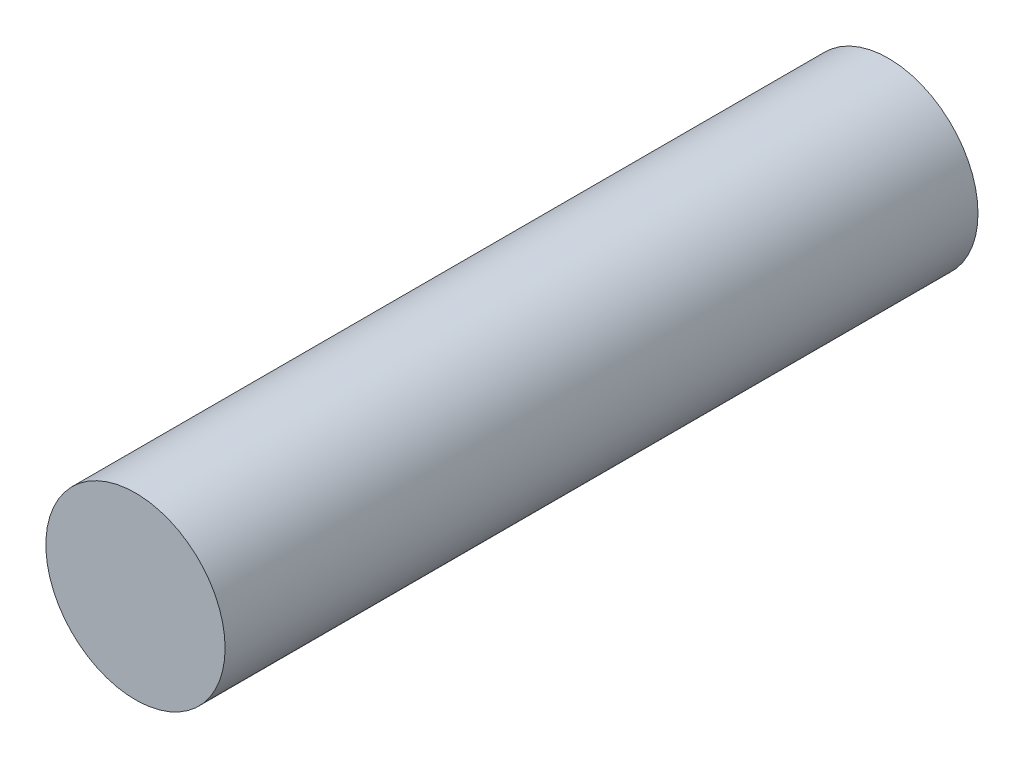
ISO-10303-21;
HEADER;
FILE_DESCRIPTION(('STEP AP214'),'2;1');
FILE_NAME('part.step','',(''),(''),'','','');
FILE_SCHEMA(('AUTOMOTIVE_DESIGN { 1 0 10303 214 1 1 1 1 }'));
ENDSEC;
DATA;
#1=APPLICATION_CONTEXT('core data for automotive mechanical design processes');
#2=APPLICATION_PROTOCOL_DEFINITION('international standard','automotive_design',2000,#1);
#3=PRODUCT_CONTEXT('',#1,'mechanical');
#4=PRODUCT('Part','Part','',(#3));
#5=PRODUCT_RELATED_PRODUCT_CATEGORY('part','',(#4));
#6=PRODUCT_DEFINITION_FORMATION('','',#4);
#7=PRODUCT_DEFINITION_CONTEXT('part definition',#1,'design');
#8=PRODUCT_DEFINITION('design','',#6,#7);
#9=PRODUCT_DEFINITION_SHAPE('','',#8);
#10=(LENGTH_UNIT() NAMED_UNIT(*) SI_UNIT(.MILLI.,.METRE.));
#11=(NAMED_UNIT(*) PLANE_ANGLE_UNIT() SI_UNIT($,.RADIAN.));
#12=(NAMED_UNIT(*) SI_UNIT($,.STERADIAN.) SOLID_ANGLE_UNIT());
#13=UNCERTAINTY_MEASURE_WITH_UNIT(LENGTH_MEASURE(1.E-05),#10,'distance_accuracy_value','');
#14=(GEOMETRIC_REPRESENTATION_CONTEXT(3) GLOBAL_UNCERTAINTY_ASSIGNED_CONTEXT((#13)) GLOBAL_UNIT_ASSIGNED_CONTEXT((#10,
#11,#12)) REPRESENTATION_CONTEXT('',''));
#15=CARTESIAN_POINT('',(0.,0.,0.));
#16=DIRECTION('',(0.,0.,1.));
#17=DIRECTION('',(1.,0.,0.));
#18=AXIS2_PLACEMENT_3D('',#15,#16,#17);
#19=CARTESIAN_POINT('',(0.,0.,-84.));
#20=DIRECTION('',(0.,0.,1.));
#21=DIRECTION('',(1.,0.,0.));
#22=AXIS2_PLACEMENT_3D('',#19,#20,#21);
#23=CYLINDRICAL_SURFACE('',#22,10.);
#24=CARTESIAN_POINT('',(0.,0.,-84.));
#25=DIRECTION('',(0.,0.,1.));
#26=DIRECTION('',(1.,0.,0.));
#27=AXIS2_PLACEMENT_3D('',#24,#25,#26);
#28=CIRCLE('',#27,10.);
#29=CARTESIAN_POINT('',(10.,0.,-84.));
#30=VERTEX_POINT('',#29);
#31=EDGE_CURVE('E10',#30,#30,#28,.T.);
#32=ORIENTED_EDGE('',*,*,#31,.T.);
#33=EDGE_LOOP('',(#32));
#34=FACE_BOUND('',#33,.T.);
#35=CARTESIAN_POINT('',(0.,0.,0.));
#36=DIRECTION('',(0.,0.,1.));
#37=DIRECTION('',(1.,0.,0.));
#38=AXIS2_PLACEMENT_3D('',#35,#36,#37);
#39=CIRCLE('',#38,10.);
#40=CARTESIAN_POINT('',(10.,0.,0.));
#41=VERTEX_POINT('',#40);
#42=EDGE_CURVE('E32',#41,#41,#39,.T.);
#43=ORIENTED_EDGE('',*,*,#42,.F.);
#44=EDGE_LOOP('',(#43));
#45=FACE_BOUND('',#44,.T.);
#46=ADVANCED_FACE('F29',(#34,#45),#23,.T.);
#47=CARTESIAN_POINT('',(0.,0.,-84.));
#48=DIRECTION('',(0.,0.,1.));
#49=DIRECTION('',(1.,0.,0.));
#50=AXIS2_PLACEMENT_3D('',#47,#48,#49);
#51=PLANE('',#50);
#52=ORIENTED_EDGE('',*,*,#31,.F.);
#53=EDGE_LOOP('',(#52));
#54=FACE_BOUND('',#53,.T.);
#55=ADVANCED_FACE('F44',(#54),#51,.F.);
#56=CARTESIAN_POINT('',(0.,0.,0.));
#57=DIRECTION('',(0.,0.,1.));
#58=DIRECTION('',(1.,0.,0.));
#59=AXIS2_PLACEMENT_3D('',#56,#57,#58);
#60=PLANE('',#59);
#61=ORIENTED_EDGE('',*,*,#42,.T.);
#62=EDGE_LOOP('',(#61));
#63=FACE_BOUND('',#62,.T.);
#64=ADVANCED_FACE('F41',(#63),#60,.T.);
#65=CLOSED_SHELL('',(#46,#55,#64));
#66=MANIFOLD_SOLID_BREP('B2',#65);
#67=ADVANCED_BREP_SHAPE_REPRESENTATION('',(#18,#66),#14);
#68=SHAPE_DEFINITION_REPRESENTATION(#9,#67);
ENDSEC;
END-ISO-10303-21;
